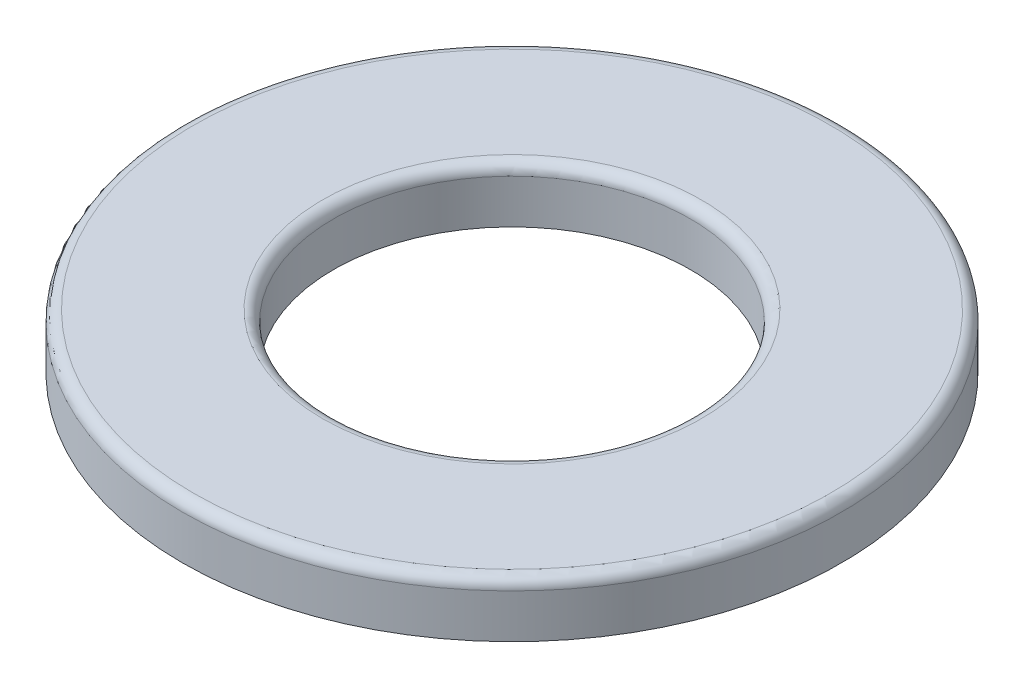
ISO-10303-21;
HEADER;
FILE_DESCRIPTION(('STEP AP214'),'2;1');
FILE_NAME('part.step','',(''),(''),'','','');
FILE_SCHEMA(('AUTOMOTIVE_DESIGN { 1 0 10303 214 1 1 1 1 }'));
ENDSEC;
DATA;
#1=APPLICATION_CONTEXT('core data for automotive mechanical design processes');
#2=APPLICATION_PROTOCOL_DEFINITION('international standard','automotive_design',2000,#1);
#3=PRODUCT_CONTEXT('',#1,'mechanical');
#4=PRODUCT('Part','Part','',(#3));
#5=PRODUCT_RELATED_PRODUCT_CATEGORY('part','',(#4));
#6=PRODUCT_DEFINITION_FORMATION('','',#4);
#7=PRODUCT_DEFINITION_CONTEXT('part definition',#1,'design');
#8=PRODUCT_DEFINITION('design','',#6,#7);
#9=PRODUCT_DEFINITION_SHAPE('','',#8);
#10=(LENGTH_UNIT() NAMED_UNIT(*) SI_UNIT(.MILLI.,.METRE.));
#11=(NAMED_UNIT(*) PLANE_ANGLE_UNIT() SI_UNIT($,.RADIAN.));
#12=(NAMED_UNIT(*) SI_UNIT($,.STERADIAN.) SOLID_ANGLE_UNIT());
#13=UNCERTAINTY_MEASURE_WITH_UNIT(LENGTH_MEASURE(1.E-05),#10,'distance_accuracy_value','');
#14=(GEOMETRIC_REPRESENTATION_CONTEXT(3) GLOBAL_UNCERTAINTY_ASSIGNED_CONTEXT((#13)) GLOBAL_UNIT_ASSIGNED_CONTEXT((#10,
#11,#12)) REPRESENTATION_CONTEXT('',''));
#15=CARTESIAN_POINT('',(0.,0.,0.));
#16=DIRECTION('',(0.,0.,1.));
#17=DIRECTION('',(1.,0.,0.));
#18=AXIS2_PLACEMENT_3D('',#15,#16,#17);
#19=CARTESIAN_POINT('',(0.,0.5,0.));
#20=DIRECTION('',(0.,1.,0.));
#21=DIRECTION('',(0.,0.,1.));
#22=AXIS2_PLACEMENT_3D('',#19,#20,#21);
#23=PLANE('',#22);
#24=CARTESIAN_POINT('',(0.,0.5,0.));
#25=DIRECTION('',(0.,1.,0.));
#26=DIRECTION('',(0.,0.,1.));
#27=AXIS2_PLACEMENT_3D('',#24,#25,#26);
#28=CIRCLE('',#27,5.8);
#29=CARTESIAN_POINT('',(0.,0.5,5.8));
#30=VERTEX_POINT('',#29);
#31=EDGE_CURVE('E46',#30,#30,#28,.T.);
#32=ORIENTED_EDGE('',*,*,#31,.T.);
#33=EDGE_LOOP('',(#32));
#34=FACE_BOUND('',#33,.T.);
#35=CARTESIAN_POINT('',(0.,0.5,0.));
#36=DIRECTION('',(0.,1.,0.));
#37=DIRECTION('',(0.,0.,1.));
#38=AXIS2_PLACEMENT_3D('',#35,#36,#37);
#39=CIRCLE('',#38,3.45);
#40=CARTESIAN_POINT('',(0.,0.5,3.45));
#41=VERTEX_POINT('',#40);
#42=EDGE_CURVE('E50',#41,#41,#39,.F.);
#43=ORIENTED_EDGE('',*,*,#42,.T.);
#44=EDGE_LOOP('',(#43));
#45=FACE_BOUND('',#44,.T.);
#46=ADVANCED_FACE('F35',(#34,#45),#23,.T.);
#47=CARTESIAN_POINT('',(0.,-0.5,0.));
#48=DIRECTION('',(0.,1.,0.));
#49=DIRECTION('',(0.,0.,1.));
#50=AXIS2_PLACEMENT_3D('',#47,#48,#49);
#51=PLANE('',#50);
#52=CARTESIAN_POINT('',(0.,-0.5,0.));
#53=DIRECTION('',(0.,1.,0.));
#54=DIRECTION('',(0.,0.,1.));
#55=AXIS2_PLACEMENT_3D('',#52,#53,#54);
#56=CIRCLE('',#55,6.);
#57=CARTESIAN_POINT('',(0.,-0.5,6.));
#58=VERTEX_POINT('',#57);
#59=EDGE_CURVE('E55',#58,#58,#56,.T.);
#60=ORIENTED_EDGE('',*,*,#59,.F.);
#61=EDGE_LOOP('',(#60));
#62=FACE_BOUND('',#61,.T.);
#63=CARTESIAN_POINT('',(0.,-0.5,0.));
#64=DIRECTION('',(0.,1.,0.));
#65=DIRECTION('',(0.,0.,1.));
#66=AXIS2_PLACEMENT_3D('',#63,#64,#65);
#67=CIRCLE('',#66,3.25);
#68=CARTESIAN_POINT('',(0.,-0.5,3.25));
#69=VERTEX_POINT('',#68);
#70=EDGE_CURVE('E58',#69,#69,#67,.T.);
#71=ORIENTED_EDGE('',*,*,#70,.T.);
#72=EDGE_LOOP('',(#71));
#73=FACE_BOUND('',#72,.T.);
#74=ADVANCED_FACE('F62',(#62,#73),#51,.F.);
#75=CARTESIAN_POINT('',(0.,0.5,0.));
#76=DIRECTION('',(0.,-1.,0.));
#77=DIRECTION('',(0.,0.,-1.));
#78=AXIS2_PLACEMENT_3D('',#75,#76,#77);
#79=CYLINDRICAL_SURFACE('',#78,6.);
#80=CARTESIAN_POINT('',(0.,0.3,0.));
#81=DIRECTION('',(0.,1.,0.));
#82=DIRECTION('',(0.,0.,1.));
#83=AXIS2_PLACEMENT_3D('',#80,#81,#82);
#84=CIRCLE('',#83,6.);
#85=CARTESIAN_POINT('',(0.,0.3,6.));
#86=VERTEX_POINT('',#85);
#87=EDGE_CURVE('E42',#86,#86,#84,.F.);
#88=ORIENTED_EDGE('',*,*,#87,.T.);
#89=EDGE_LOOP('',(#88));
#90=FACE_BOUND('',#89,.T.);
#91=ORIENTED_EDGE('',*,*,#59,.T.);
#92=EDGE_LOOP('',(#91));
#93=FACE_BOUND('',#92,.T.);
#94=ADVANCED_FACE('F67',(#90,#93),#79,.T.);
#95=CARTESIAN_POINT('',(0.,0.5,0.));
#96=DIRECTION('',(0.,-1.,0.));
#97=DIRECTION('',(0.,0.,-1.));
#98=AXIS2_PLACEMENT_3D('',#95,#96,#97);
#99=CYLINDRICAL_SURFACE('',#98,3.25);
#100=CARTESIAN_POINT('',(0.,0.3,0.));
#101=DIRECTION('',(0.,1.,0.));
#102=DIRECTION('',(0.,0.,1.));
#103=AXIS2_PLACEMENT_3D('',#100,#101,#102);
#104=CIRCLE('',#103,3.25);
#105=CARTESIAN_POINT('',(0.,0.3,3.25));
#106=VERTEX_POINT('',#105);
#107=EDGE_CURVE('E10',#106,#106,#104,.T.);
#108=ORIENTED_EDGE('',*,*,#107,.T.);
#109=EDGE_LOOP('',(#108));
#110=FACE_BOUND('',#109,.T.);
#111=ORIENTED_EDGE('',*,*,#70,.F.);
#112=EDGE_LOOP('',(#111));
#113=FACE_BOUND('',#112,.T.);
#114=ADVANCED_FACE('F64',(#110,#113),#99,.F.);
#115=CARTESIAN_POINT('',(0.,0.3,0.));
#116=DIRECTION('',(0.,1.,0.));
#117=DIRECTION('',(0.,0.,1.));
#118=AXIS2_PLACEMENT_3D('',#115,#116,#117);
#119=TOROIDAL_SURFACE('',#118,5.8,0.2);
#120=ORIENTED_EDGE('',*,*,#87,.F.);
#121=EDGE_LOOP('',(#120));
#122=FACE_BOUND('',#121,.T.);
#123=ORIENTED_EDGE('',*,*,#31,.F.);
#124=EDGE_LOOP('',(#123));
#125=FACE_BOUND('',#124,.T.);
#126=ADVANCED_FACE('F66',(#122,#125),#119,.T.);
#127=CARTESIAN_POINT('',(0.,0.3,0.));
#128=DIRECTION('',(0.,1.,0.));
#129=DIRECTION('',(0.,0.,1.));
#130=AXIS2_PLACEMENT_3D('',#127,#128,#129);
#131=TOROIDAL_SURFACE('',#130,3.45,0.2);
#132=ORIENTED_EDGE('',*,*,#42,.F.);
#133=EDGE_LOOP('',(#132));
#134=FACE_BOUND('',#133,.T.);
#135=ORIENTED_EDGE('',*,*,#107,.F.);
#136=EDGE_LOOP('',(#135));
#137=FACE_BOUND('',#136,.T.);
#138=ADVANCED_FACE('F37',(#134,#137),#131,.T.);
#139=CLOSED_SHELL('',(#46,#74,#94,#114,#126,#138));
#140=MANIFOLD_SOLID_BREP('B2',#139);
#141=ADVANCED_BREP_SHAPE_REPRESENTATION('',(#18,#140),#14);
#142=SHAPE_DEFINITION_REPRESENTATION(#9,#141);
ENDSEC;
END-ISO-10303-21;
